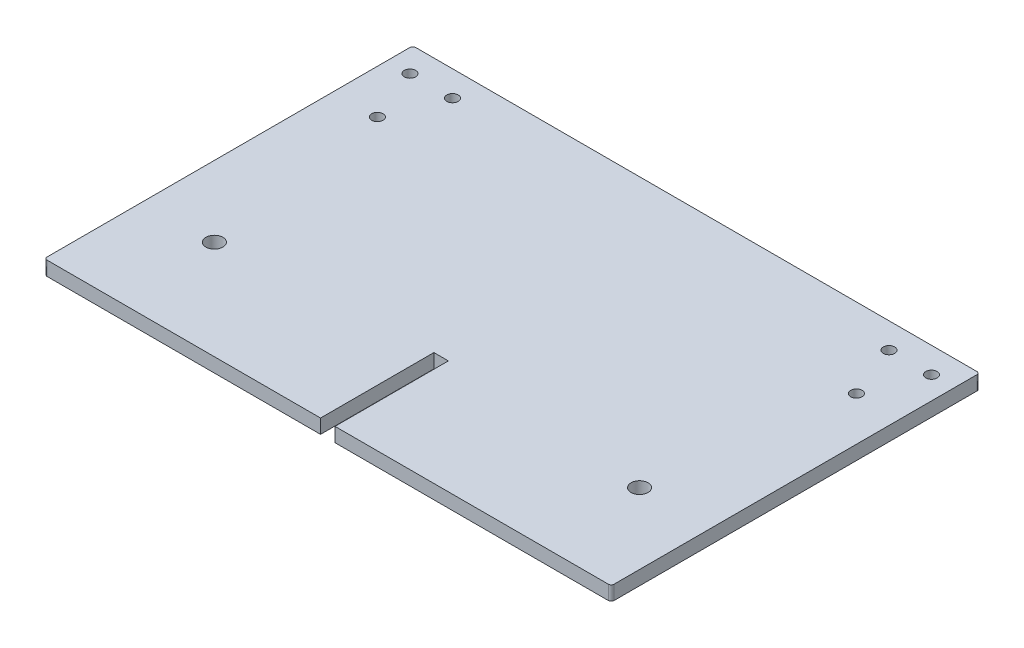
ISO-10303-21;
HEADER;
FILE_DESCRIPTION(('STEP AP214'),'2;1');
FILE_NAME('part.step','',(''),(''),'','','');
FILE_SCHEMA(('AUTOMOTIVE_DESIGN { 1 0 10303 214 1 1 1 1 }'));
ENDSEC;
DATA;
#1=APPLICATION_CONTEXT('core data for automotive mechanical design processes');
#2=APPLICATION_PROTOCOL_DEFINITION('international standard','automotive_design',2000,#1);
#3=PRODUCT_CONTEXT('',#1,'mechanical');
#4=PRODUCT('Part','Part','',(#3));
#5=PRODUCT_RELATED_PRODUCT_CATEGORY('part','',(#4));
#6=PRODUCT_DEFINITION_FORMATION('','',#4);
#7=PRODUCT_DEFINITION_CONTEXT('part definition',#1,'design');
#8=PRODUCT_DEFINITION('design','',#6,#7);
#9=PRODUCT_DEFINITION_SHAPE('','',#8);
#10=(LENGTH_UNIT() NAMED_UNIT(*) SI_UNIT(.MILLI.,.METRE.));
#11=(NAMED_UNIT(*) PLANE_ANGLE_UNIT() SI_UNIT($,.RADIAN.));
#12=(NAMED_UNIT(*) SI_UNIT($,.STERADIAN.) SOLID_ANGLE_UNIT());
#13=UNCERTAINTY_MEASURE_WITH_UNIT(LENGTH_MEASURE(1.E-05),#10,'distance_accuracy_value','');
#14=(GEOMETRIC_REPRESENTATION_CONTEXT(3) GLOBAL_UNCERTAINTY_ASSIGNED_CONTEXT((#13)) GLOBAL_UNIT_ASSIGNED_CONTEXT((#10,
#11,#12)) REPRESENTATION_CONTEXT('',''));
#15=CARTESIAN_POINT('',(0.,0.,0.));
#16=DIRECTION('',(0.,0.,1.));
#17=DIRECTION('',(1.,0.,0.));
#18=AXIS2_PLACEMENT_3D('',#15,#16,#17);
#19=CARTESIAN_POINT('',(0.,5.,0.));
#20=DIRECTION('',(0.,1.,0.));
#21=DIRECTION('',(0.,0.,1.));
#22=AXIS2_PLACEMENT_3D('',#19,#20,#21);
#23=PLANE('',#22);
#24=CARTESIAN_POINT('',(177.,5.,9.));
#25=DIRECTION('',(0.,1.,0.));
#26=DIRECTION('',(0.,0.,-1.));
#27=AXIS2_PLACEMENT_3D('',#24,#25,#26);
#28=CIRCLE('',#27,2.);
#29=CARTESIAN_POINT('',(177.,5.,7.));
#30=VERTEX_POINT('',#29);
#31=EDGE_CURVE('E275',#30,#30,#28,.T.);
#32=ORIENTED_EDGE('',*,*,#31,.F.);
#33=EDGE_LOOP('',(#32));
#34=FACE_BOUND('',#33,.T.);
#35=CARTESIAN_POINT('',(175.,5.,94.9999999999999));
#36=DIRECTION('',(0.,1.,0.));
#37=DIRECTION('',(0.,0.,-1.));
#38=AXIS2_PLACEMENT_3D('',#35,#36,#37);
#39=CIRCLE('',#38,3.00000000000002);
#40=CARTESIAN_POINT('',(175.,5.,91.9999999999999));
#41=VERTEX_POINT('',#40);
#42=EDGE_CURVE('E263',#41,#41,#39,.T.);
#43=ORIENTED_EDGE('',*,*,#42,.F.);
#44=EDGE_LOOP('',(#43));
#45=FACE_BOUND('',#44,.T.);
#46=CARTESIAN_POINT('',(15.5,5.,28.));
#47=DIRECTION('',(0.,1.,0.));
#48=DIRECTION('',(0.,0.,1.));
#49=AXIS2_PLACEMENT_3D('',#46,#47,#48);
#50=CIRCLE('',#49,2.00000000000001);
#51=CARTESIAN_POINT('',(15.5,5.,30.));
#52=VERTEX_POINT('',#51);
#53=EDGE_CURVE('E251',#52,#52,#50,.T.);
#54=ORIENTED_EDGE('',*,*,#53,.F.);
#55=EDGE_LOOP('',(#54));
#56=FACE_BOUND('',#55,.T.);
#57=CARTESIAN_POINT('',(8.,5.,9.));
#58=DIRECTION('',(0.,1.,0.));
#59=DIRECTION('',(0.,0.,1.));
#60=AXIS2_PLACEMENT_3D('',#57,#58,#59);
#61=CIRCLE('',#60,2.);
#62=CARTESIAN_POINT('',(8.,5.,11.));
#63=VERTEX_POINT('',#62);
#64=EDGE_CURVE('E164',#63,#63,#61,.T.);
#65=ORIENTED_EDGE('',*,*,#64,.F.);
#66=EDGE_LOOP('',(#65));
#67=FACE_BOUND('',#66,.T.);
#68=DIRECTION('',(-1.,0.,0.));
#69=VECTOR('',#68,1.);
#70=CARTESIAN_POINT('',(0.,5.,0.));
#71=LINE('',#70,#69);
#72=CARTESIAN_POINT('',(199.,5.,0.));
#73=VERTEX_POINT('',#72);
#74=CARTESIAN_POINT('',(1.,5.,0.));
#75=VERTEX_POINT('',#74);
#76=EDGE_CURVE('E158',#73,#75,#71,.T.);
#77=ORIENTED_EDGE('',*,*,#76,.T.);
#78=CARTESIAN_POINT('',(1.,5.,1.));
#79=DIRECTION('',(0.,1.,0.));
#80=DIRECTION('',(0.,0.,1.));
#81=AXIS2_PLACEMENT_3D('',#78,#79,#80);
#82=CIRCLE('',#81,1.);
#83=CARTESIAN_POINT('',(0.,5.,1.));
#84=VERTEX_POINT('',#83);
#85=EDGE_CURVE('E207',#75,#84,#82,.T.);
#86=ORIENTED_EDGE('',*,*,#85,.T.);
#87=DIRECTION('',(0.,0.,1.));
#88=VECTOR('',#87,1.);
#89=CARTESIAN_POINT('',(0.,5.,0.));
#90=LINE('',#89,#88);
#91=CARTESIAN_POINT('',(0.,5.,129.));
#92=VERTEX_POINT('',#91);
#93=EDGE_CURVE('E132',#84,#92,#90,.T.);
#94=ORIENTED_EDGE('',*,*,#93,.T.);
#95=CARTESIAN_POINT('',(1.00000000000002,5.,129.));
#96=DIRECTION('',(0.,1.,0.));
#97=DIRECTION('',(0.,0.,1.));
#98=AXIS2_PLACEMENT_3D('',#95,#96,#97);
#99=CIRCLE('',#98,1.);
#100=CARTESIAN_POINT('',(1.00000000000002,5.,130.));
#101=VERTEX_POINT('',#100);
#102=EDGE_CURVE('E128',#92,#101,#99,.T.);
#103=ORIENTED_EDGE('',*,*,#102,.T.);
#104=DIRECTION('',(1.,0.,0.));
#105=VECTOR('',#104,1.);
#106=CARTESIAN_POINT('',(0.,5.,130.));
#107=LINE('',#106,#105);
#108=CARTESIAN_POINT('',(97.45,5.,130.));
#109=VERTEX_POINT('',#108);
#110=EDGE_CURVE('E119',#101,#109,#107,.T.);
#111=ORIENTED_EDGE('',*,*,#110,.T.);
#112=DIRECTION('',(0.,0.,-1.));
#113=VECTOR('',#112,1.);
#114=CARTESIAN_POINT('',(97.45,5.,130.));
#115=LINE('',#114,#113);
#116=CARTESIAN_POINT('',(97.45,5.,90.));
#117=VERTEX_POINT('',#116);
#118=EDGE_CURVE('E124',#109,#117,#115,.T.);
#119=ORIENTED_EDGE('',*,*,#118,.T.);
#120=DIRECTION('',(1.,0.,0.));
#121=VECTOR('',#120,1.);
#122=CARTESIAN_POINT('',(102.55,5.,90.));
#123=LINE('',#122,#121);
#124=CARTESIAN_POINT('',(102.55,5.,90.));
#125=VERTEX_POINT('',#124);
#126=EDGE_CURVE('E147',#117,#125,#123,.T.);
#127=ORIENTED_EDGE('',*,*,#126,.T.);
#128=DIRECTION('',(0.,0.,1.));
#129=VECTOR('',#128,1.);
#130=CARTESIAN_POINT('',(102.55,5.,130.));
#131=LINE('',#130,#129);
#132=CARTESIAN_POINT('',(102.55,5.,130.));
#133=VERTEX_POINT('',#132);
#134=EDGE_CURVE('E149',#125,#133,#131,.T.);
#135=ORIENTED_EDGE('',*,*,#134,.T.);
#136=DIRECTION('',(1.,0.,0.));
#137=VECTOR('',#136,1.);
#138=CARTESIAN_POINT('',(102.55,5.,130.));
#139=LINE('',#138,#137);
#140=CARTESIAN_POINT('',(199.,5.,130.));
#141=VERTEX_POINT('',#140);
#142=EDGE_CURVE('E154',#133,#141,#139,.T.);
#143=ORIENTED_EDGE('',*,*,#142,.T.);
#144=CARTESIAN_POINT('',(199.,5.,129.));
#145=DIRECTION('',(0.,1.,0.));
#146=DIRECTION('',(0.,0.,1.));
#147=AXIS2_PLACEMENT_3D('',#144,#145,#146);
#148=CIRCLE('',#147,1.);
#149=CARTESIAN_POINT('',(200.,5.,129.));
#150=VERTEX_POINT('',#149);
#151=EDGE_CURVE('E53',#141,#150,#148,.T.);
#152=ORIENTED_EDGE('',*,*,#151,.T.);
#153=DIRECTION('',(0.,0.,-1.));
#154=VECTOR('',#153,1.);
#155=CARTESIAN_POINT('',(200.,5.,0.));
#156=LINE('',#155,#154);
#157=CARTESIAN_POINT('',(200.,5.,1.));
#158=VERTEX_POINT('',#157);
#159=EDGE_CURVE('E156',#150,#158,#156,.T.);
#160=ORIENTED_EDGE('',*,*,#159,.T.);
#161=CARTESIAN_POINT('',(199.,5.,1.));
#162=DIRECTION('',(0.,1.,0.));
#163=DIRECTION('',(0.,0.,1.));
#164=AXIS2_PLACEMENT_3D('',#161,#162,#163);
#165=CIRCLE('',#164,1.);
#166=EDGE_CURVE('E204',#158,#73,#165,.T.);
#167=ORIENTED_EDGE('',*,*,#166,.T.);
#168=EDGE_LOOP('',(#77,#86,#94,#103,#111,#119,#127,#135,#143,#152,#160,#167));
#169=FACE_BOUND('',#168,.T.);
#170=CARTESIAN_POINT('',(23.,5.,9.));
#171=DIRECTION('',(0.,1.,0.));
#172=DIRECTION('',(0.,0.,1.));
#173=AXIS2_PLACEMENT_3D('',#170,#171,#172);
#174=CIRCLE('',#173,2.);
#175=CARTESIAN_POINT('',(23.,5.,11.));
#176=VERTEX_POINT('',#175);
#177=EDGE_CURVE('E245',#176,#176,#174,.T.);
#178=ORIENTED_EDGE('',*,*,#177,.F.);
#179=EDGE_LOOP('',(#178));
#180=FACE_BOUND('',#179,.T.);
#181=CARTESIAN_POINT('',(25.,5.,95.));
#182=DIRECTION('',(0.,1.,0.));
#183=DIRECTION('',(0.,0.,1.));
#184=AXIS2_PLACEMENT_3D('',#181,#182,#183);
#185=CIRCLE('',#184,3.);
#186=CARTESIAN_POINT('',(25.,5.,98.));
#187=VERTEX_POINT('',#186);
#188=EDGE_CURVE('E257',#187,#187,#185,.T.);
#189=ORIENTED_EDGE('',*,*,#188,.F.);
#190=EDGE_LOOP('',(#189));
#191=FACE_BOUND('',#190,.T.);
#192=CARTESIAN_POINT('',(184.5,5.,28.));
#193=DIRECTION('',(0.,1.,0.));
#194=DIRECTION('',(0.,0.,-1.));
#195=AXIS2_PLACEMENT_3D('',#192,#193,#194);
#196=CIRCLE('',#195,2.00000000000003);
#197=CARTESIAN_POINT('',(184.5,5.,26.));
#198=VERTEX_POINT('',#197);
#199=EDGE_CURVE('E269',#198,#198,#196,.T.);
#200=ORIENTED_EDGE('',*,*,#199,.F.);
#201=EDGE_LOOP('',(#200));
#202=FACE_BOUND('',#201,.T.);
#203=CARTESIAN_POINT('',(192.,5.,9.));
#204=DIRECTION('',(0.,1.,0.));
#205=DIRECTION('',(0.,0.,-1.));
#206=AXIS2_PLACEMENT_3D('',#203,#204,#205);
#207=CIRCLE('',#206,2.);
#208=CARTESIAN_POINT('',(192.,5.,7.));
#209=VERTEX_POINT('',#208);
#210=EDGE_CURVE('E281',#209,#209,#207,.T.);
#211=ORIENTED_EDGE('',*,*,#210,.F.);
#212=EDGE_LOOP('',(#211));
#213=FACE_BOUND('',#212,.T.);
#214=ADVANCED_FACE('F32',(#34,#45,#56,#67,#169,#180,#191,#202,#213),#23,.T.);
#215=CARTESIAN_POINT('',(0.,0.,0.));
#216=DIRECTION('',(0.,1.,0.));
#217=DIRECTION('',(0.,0.,1.));
#218=AXIS2_PLACEMENT_3D('',#215,#216,#217);
#219=PLANE('',#218);
#220=CARTESIAN_POINT('',(177.,0.,9.));
#221=DIRECTION('',(0.,1.,0.));
#222=DIRECTION('',(0.,0.,-1.));
#223=AXIS2_PLACEMENT_3D('',#220,#221,#222);
#224=CIRCLE('',#223,2.);
#225=CARTESIAN_POINT('',(177.,0.,7.));
#226=VERTEX_POINT('',#225);
#227=EDGE_CURVE('E278',#226,#226,#224,.T.);
#228=ORIENTED_EDGE('',*,*,#227,.T.);
#229=EDGE_LOOP('',(#228));
#230=FACE_BOUND('',#229,.T.);
#231=CARTESIAN_POINT('',(175.,0.,94.9999999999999));
#232=DIRECTION('',(0.,1.,0.));
#233=DIRECTION('',(0.,0.,-1.));
#234=AXIS2_PLACEMENT_3D('',#231,#232,#233);
#235=CIRCLE('',#234,3.00000000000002);
#236=CARTESIAN_POINT('',(175.,0.,91.9999999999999));
#237=VERTEX_POINT('',#236);
#238=EDGE_CURVE('E266',#237,#237,#235,.T.);
#239=ORIENTED_EDGE('',*,*,#238,.T.);
#240=EDGE_LOOP('',(#239));
#241=FACE_BOUND('',#240,.T.);
#242=CARTESIAN_POINT('',(15.5,0.,28.));
#243=DIRECTION('',(0.,1.,0.));
#244=DIRECTION('',(0.,0.,1.));
#245=AXIS2_PLACEMENT_3D('',#242,#243,#244);
#246=CIRCLE('',#245,2.00000000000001);
#247=CARTESIAN_POINT('',(15.5,0.,30.));
#248=VERTEX_POINT('',#247);
#249=EDGE_CURVE('E254',#248,#248,#246,.T.);
#250=ORIENTED_EDGE('',*,*,#249,.T.);
#251=EDGE_LOOP('',(#250));
#252=FACE_BOUND('',#251,.T.);
#253=CARTESIAN_POINT('',(8.,0.,9.));
#254=DIRECTION('',(0.,1.,0.));
#255=DIRECTION('',(0.,0.,1.));
#256=AXIS2_PLACEMENT_3D('',#253,#254,#255);
#257=CIRCLE('',#256,2.);
#258=CARTESIAN_POINT('',(8.,0.,11.));
#259=VERTEX_POINT('',#258);
#260=EDGE_CURVE('E242',#259,#259,#257,.T.);
#261=ORIENTED_EDGE('',*,*,#260,.T.);
#262=EDGE_LOOP('',(#261));
#263=FACE_BOUND('',#262,.T.);
#264=DIRECTION('',(0.,0.,1.));
#265=VECTOR('',#264,1.);
#266=CARTESIAN_POINT('',(0.,0.,0.));
#267=LINE('',#266,#265);
#268=CARTESIAN_POINT('',(0.,0.,1.));
#269=VERTEX_POINT('',#268);
#270=CARTESIAN_POINT('',(0.,0.,129.));
#271=VERTEX_POINT('',#270);
#272=EDGE_CURVE('E161',#269,#271,#267,.T.);
#273=ORIENTED_EDGE('',*,*,#272,.F.);
#274=CARTESIAN_POINT('',(1.,0.,1.));
#275=DIRECTION('',(0.,1.,0.));
#276=DIRECTION('',(0.,0.,1.));
#277=AXIS2_PLACEMENT_3D('',#274,#275,#276);
#278=CIRCLE('',#277,1.);
#279=CARTESIAN_POINT('',(1.,0.,0.));
#280=VERTEX_POINT('',#279);
#281=EDGE_CURVE('E196',#269,#280,#278,.F.);
#282=ORIENTED_EDGE('',*,*,#281,.T.);
#283=DIRECTION('',(-1.,0.,0.));
#284=VECTOR('',#283,1.);
#285=CARTESIAN_POINT('',(0.,0.,0.));
#286=LINE('',#285,#284);
#287=CARTESIAN_POINT('',(199.,0.,0.));
#288=VERTEX_POINT('',#287);
#289=EDGE_CURVE('E177',#288,#280,#286,.T.);
#290=ORIENTED_EDGE('',*,*,#289,.F.);
#291=CARTESIAN_POINT('',(199.,0.,1.));
#292=DIRECTION('',(0.,1.,0.));
#293=DIRECTION('',(0.,0.,1.));
#294=AXIS2_PLACEMENT_3D('',#291,#292,#293);
#295=CIRCLE('',#294,1.);
#296=CARTESIAN_POINT('',(200.,0.,1.));
#297=VERTEX_POINT('',#296);
#298=EDGE_CURVE('E192',#288,#297,#295,.F.);
#299=ORIENTED_EDGE('',*,*,#298,.T.);
#300=DIRECTION('',(0.,0.,-1.));
#301=VECTOR('',#300,1.);
#302=CARTESIAN_POINT('',(200.,0.,0.));
#303=LINE('',#302,#301);
#304=CARTESIAN_POINT('',(200.,0.,129.));
#305=VERTEX_POINT('',#304);
#306=EDGE_CURVE('E175',#305,#297,#303,.T.);
#307=ORIENTED_EDGE('',*,*,#306,.F.);
#308=CARTESIAN_POINT('',(199.,0.,129.));
#309=DIRECTION('',(0.,1.,0.));
#310=DIRECTION('',(0.,0.,1.));
#311=AXIS2_PLACEMENT_3D('',#308,#309,#310);
#312=CIRCLE('',#311,1.);
#313=CARTESIAN_POINT('',(199.,0.,130.));
#314=VERTEX_POINT('',#313);
#315=EDGE_CURVE('E190',#305,#314,#312,.F.);
#316=ORIENTED_EDGE('',*,*,#315,.T.);
#317=DIRECTION('',(1.,0.,0.));
#318=VECTOR('',#317,1.);
#319=CARTESIAN_POINT('',(102.55,0.,130.));
#320=LINE('',#319,#318);
#321=CARTESIAN_POINT('',(102.55,0.,130.));
#322=VERTEX_POINT('',#321);
#323=EDGE_CURVE('E172',#322,#314,#320,.T.);
#324=ORIENTED_EDGE('',*,*,#323,.F.);
#325=DIRECTION('',(0.,0.,1.));
#326=VECTOR('',#325,1.);
#327=CARTESIAN_POINT('',(102.55,0.,130.));
#328=LINE('',#327,#326);
#329=CARTESIAN_POINT('',(102.55,0.,90.));
#330=VERTEX_POINT('',#329);
#331=EDGE_CURVE('E170',#330,#322,#328,.T.);
#332=ORIENTED_EDGE('',*,*,#331,.F.);
#333=DIRECTION('',(1.,0.,0.));
#334=VECTOR('',#333,1.);
#335=CARTESIAN_POINT('',(102.55,0.,90.));
#336=LINE('',#335,#334);
#337=CARTESIAN_POINT('',(97.45,0.,90.));
#338=VERTEX_POINT('',#337);
#339=EDGE_CURVE('E168',#338,#330,#336,.T.);
#340=ORIENTED_EDGE('',*,*,#339,.F.);
#341=DIRECTION('',(0.,0.,-1.));
#342=VECTOR('',#341,1.);
#343=CARTESIAN_POINT('',(97.45,0.,130.));
#344=LINE('',#343,#342);
#345=CARTESIAN_POINT('',(97.45,0.,130.));
#346=VERTEX_POINT('',#345);
#347=EDGE_CURVE('E166',#346,#338,#344,.T.);
#348=ORIENTED_EDGE('',*,*,#347,.F.);
#349=DIRECTION('',(1.,0.,0.));
#350=VECTOR('',#349,1.);
#351=CARTESIAN_POINT('',(0.,0.,130.));
#352=LINE('',#351,#350);
#353=CARTESIAN_POINT('',(1.00000000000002,0.,130.));
#354=VERTEX_POINT('',#353);
#355=EDGE_CURVE('E138',#354,#346,#352,.T.);
#356=ORIENTED_EDGE('',*,*,#355,.F.);
#357=CARTESIAN_POINT('',(1.00000000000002,0.,129.));
#358=DIRECTION('',(0.,1.,0.));
#359=DIRECTION('',(0.,0.,1.));
#360=AXIS2_PLACEMENT_3D('',#357,#358,#359);
#361=CIRCLE('',#360,1.);
#362=EDGE_CURVE('E194',#354,#271,#361,.F.);
#363=ORIENTED_EDGE('',*,*,#362,.T.);
#364=EDGE_LOOP('',(#273,#282,#290,#299,#307,#316,#324,#332,#340,#348,#356,#363));
#365=FACE_BOUND('',#364,.T.);
#366=CARTESIAN_POINT('',(23.,0.,9.));
#367=DIRECTION('',(0.,1.,0.));
#368=DIRECTION('',(0.,0.,1.));
#369=AXIS2_PLACEMENT_3D('',#366,#367,#368);
#370=CIRCLE('',#369,2.);
#371=CARTESIAN_POINT('',(23.,0.,11.));
#372=VERTEX_POINT('',#371);
#373=EDGE_CURVE('E248',#372,#372,#370,.T.);
#374=ORIENTED_EDGE('',*,*,#373,.T.);
#375=EDGE_LOOP('',(#374));
#376=FACE_BOUND('',#375,.T.);
#377=CARTESIAN_POINT('',(25.,0.,95.));
#378=DIRECTION('',(0.,1.,0.));
#379=DIRECTION('',(0.,0.,1.));
#380=AXIS2_PLACEMENT_3D('',#377,#378,#379);
#381=CIRCLE('',#380,3.);
#382=CARTESIAN_POINT('',(25.,0.,98.));
#383=VERTEX_POINT('',#382);
#384=EDGE_CURVE('E260',#383,#383,#381,.T.);
#385=ORIENTED_EDGE('',*,*,#384,.T.);
#386=EDGE_LOOP('',(#385));
#387=FACE_BOUND('',#386,.T.);
#388=CARTESIAN_POINT('',(184.5,0.,28.));
#389=DIRECTION('',(0.,1.,0.));
#390=DIRECTION('',(0.,0.,-1.));
#391=AXIS2_PLACEMENT_3D('',#388,#389,#390);
#392=CIRCLE('',#391,2.00000000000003);
#393=CARTESIAN_POINT('',(184.5,0.,26.));
#394=VERTEX_POINT('',#393);
#395=EDGE_CURVE('E272',#394,#394,#392,.T.);
#396=ORIENTED_EDGE('',*,*,#395,.T.);
#397=EDGE_LOOP('',(#396));
#398=FACE_BOUND('',#397,.T.);
#399=CARTESIAN_POINT('',(192.,0.,9.));
#400=DIRECTION('',(0.,1.,0.));
#401=DIRECTION('',(0.,0.,-1.));
#402=AXIS2_PLACEMENT_3D('',#399,#400,#401);
#403=CIRCLE('',#402,2.);
#404=CARTESIAN_POINT('',(192.,0.,7.));
#405=VERTEX_POINT('',#404);
#406=EDGE_CURVE('E284',#405,#405,#403,.T.);
#407=ORIENTED_EDGE('',*,*,#406,.T.);
#408=EDGE_LOOP('',(#407));
#409=FACE_BOUND('',#408,.T.);
#410=ADVANCED_FACE('F219',(#230,#241,#252,#263,#365,#376,#387,#398,#409),#219,.F.);
#411=CARTESIAN_POINT('',(0.,5.,0.));
#412=DIRECTION('',(1.,0.,0.));
#413=DIRECTION('',(0.,0.,-1.));
#414=AXIS2_PLACEMENT_3D('',#411,#412,#413);
#415=PLANE('',#414);
#416=ORIENTED_EDGE('',*,*,#93,.F.);
#417=DIRECTION('',(0.,-1.,0.));
#418=VECTOR('',#417,1.);
#419=CARTESIAN_POINT('',(0.,5.,1.));
#420=LINE('',#419,#418);
#421=EDGE_CURVE('E187',#84,#269,#420,.T.);
#422=ORIENTED_EDGE('',*,*,#421,.T.);
#423=ORIENTED_EDGE('',*,*,#272,.T.);
#424=DIRECTION('',(0.,-1.,0.));
#425=VECTOR('',#424,1.);
#426=CARTESIAN_POINT('',(0.,5.,129.));
#427=LINE('',#426,#425);
#428=EDGE_CURVE('E141',#271,#92,#427,.F.);
#429=ORIENTED_EDGE('',*,*,#428,.T.);
#430=EDGE_LOOP('',(#416,#422,#423,#429));
#431=FACE_BOUND('',#430,.T.);
#432=ADVANCED_FACE('F237',(#431),#415,.F.);
#433=CARTESIAN_POINT('',(0.,5.,130.));
#434=DIRECTION('',(0.,0.,-1.));
#435=DIRECTION('',(-1.,0.,0.));
#436=AXIS2_PLACEMENT_3D('',#433,#434,#435);
#437=PLANE('',#436);
#438=ORIENTED_EDGE('',*,*,#110,.F.);
#439=DIRECTION('',(0.,-1.,0.));
#440=VECTOR('',#439,1.);
#441=CARTESIAN_POINT('',(1.00000000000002,5.,130.));
#442=LINE('',#441,#440);
#443=EDGE_CURVE('E209',#101,#354,#442,.T.);
#444=ORIENTED_EDGE('',*,*,#443,.T.);
#445=ORIENTED_EDGE('',*,*,#355,.T.);
#446=DIRECTION('',(0.,-1.,0.));
#447=VECTOR('',#446,1.);
#448=CARTESIAN_POINT('',(97.45,5.,130.));
#449=LINE('',#448,#447);
#450=EDGE_CURVE('E135',#109,#346,#449,.T.);
#451=ORIENTED_EDGE('',*,*,#450,.F.);
#452=EDGE_LOOP('',(#438,#444,#445,#451));
#453=FACE_BOUND('',#452,.T.);
#454=ADVANCED_FACE('F136',(#453),#437,.F.);
#455=CARTESIAN_POINT('',(97.45,5.,130.));
#456=DIRECTION('',(-1.,0.,0.));
#457=DIRECTION('',(0.,0.,1.));
#458=AXIS2_PLACEMENT_3D('',#455,#456,#457);
#459=PLANE('',#458);
#460=ORIENTED_EDGE('',*,*,#347,.T.);
#461=DIRECTION('',(0.,-1.,0.));
#462=VECTOR('',#461,1.);
#463=CARTESIAN_POINT('',(97.45,5.,90.));
#464=LINE('',#463,#462);
#465=EDGE_CURVE('E142',#117,#338,#464,.T.);
#466=ORIENTED_EDGE('',*,*,#465,.F.);
#467=ORIENTED_EDGE('',*,*,#118,.F.);
#468=ORIENTED_EDGE('',*,*,#450,.T.);
#469=EDGE_LOOP('',(#460,#466,#467,#468));
#470=FACE_BOUND('',#469,.T.);
#471=ADVANCED_FACE('F144',(#470),#459,.F.);
#472=CARTESIAN_POINT('',(102.55,5.,90.));
#473=DIRECTION('',(0.,0.,-1.));
#474=DIRECTION('',(-1.,0.,0.));
#475=AXIS2_PLACEMENT_3D('',#472,#473,#474);
#476=PLANE('',#475);
#477=ORIENTED_EDGE('',*,*,#339,.T.);
#478=DIRECTION('',(0.,-1.,0.));
#479=VECTOR('',#478,1.);
#480=CARTESIAN_POINT('',(102.55,5.,90.));
#481=LINE('',#480,#479);
#482=EDGE_CURVE('E182',#125,#330,#481,.T.);
#483=ORIENTED_EDGE('',*,*,#482,.F.);
#484=ORIENTED_EDGE('',*,*,#126,.F.);
#485=ORIENTED_EDGE('',*,*,#465,.T.);
#486=EDGE_LOOP('',(#477,#483,#484,#485));
#487=FACE_BOUND('',#486,.T.);
#488=ADVANCED_FACE('F318',(#487),#476,.F.);
#489=CARTESIAN_POINT('',(102.55,5.,130.));
#490=DIRECTION('',(1.,0.,0.));
#491=DIRECTION('',(0.,0.,-1.));
#492=AXIS2_PLACEMENT_3D('',#489,#490,#491);
#493=PLANE('',#492);
#494=ORIENTED_EDGE('',*,*,#331,.T.);
#495=DIRECTION('',(0.,-1.,0.));
#496=VECTOR('',#495,1.);
#497=CARTESIAN_POINT('',(102.55,5.,130.));
#498=LINE('',#497,#496);
#499=EDGE_CURVE('E160',#133,#322,#498,.T.);
#500=ORIENTED_EDGE('',*,*,#499,.F.);
#501=ORIENTED_EDGE('',*,*,#134,.F.);
#502=ORIENTED_EDGE('',*,*,#482,.T.);
#503=EDGE_LOOP('',(#494,#500,#501,#502));
#504=FACE_BOUND('',#503,.T.);
#505=ADVANCED_FACE('F314',(#504),#493,.F.);
#506=CARTESIAN_POINT('',(102.55,5.,130.));
#507=DIRECTION('',(0.,0.,-1.));
#508=DIRECTION('',(-1.,0.,0.));
#509=AXIS2_PLACEMENT_3D('',#506,#507,#508);
#510=PLANE('',#509);
#511=ORIENTED_EDGE('',*,*,#323,.T.);
#512=DIRECTION('',(0.,-1.,0.));
#513=VECTOR('',#512,1.);
#514=CARTESIAN_POINT('',(199.,5.,130.));
#515=LINE('',#514,#513);
#516=EDGE_CURVE('E11',#314,#141,#515,.F.);
#517=ORIENTED_EDGE('',*,*,#516,.T.);
#518=ORIENTED_EDGE('',*,*,#142,.F.);
#519=ORIENTED_EDGE('',*,*,#499,.T.);
#520=EDGE_LOOP('',(#511,#517,#518,#519));
#521=FACE_BOUND('',#520,.T.);
#522=ADVANCED_FACE('F311',(#521),#510,.F.);
#523=CARTESIAN_POINT('',(200.,5.,0.));
#524=DIRECTION('',(-1.,0.,0.));
#525=DIRECTION('',(0.,0.,1.));
#526=AXIS2_PLACEMENT_3D('',#523,#524,#525);
#527=PLANE('',#526);
#528=ORIENTED_EDGE('',*,*,#306,.T.);
#529=DIRECTION('',(0.,-1.,0.));
#530=VECTOR('',#529,1.);
#531=CARTESIAN_POINT('',(200.,5.,1.));
#532=LINE('',#531,#530);
#533=EDGE_CURVE('E40',#297,#158,#532,.F.);
#534=ORIENTED_EDGE('',*,*,#533,.T.);
#535=ORIENTED_EDGE('',*,*,#159,.F.);
#536=DIRECTION('',(0.,-1.,0.));
#537=VECTOR('',#536,1.);
#538=CARTESIAN_POINT('',(200.,5.,129.));
#539=LINE('',#538,#537);
#540=EDGE_CURVE('E211',#150,#305,#539,.T.);
#541=ORIENTED_EDGE('',*,*,#540,.T.);
#542=EDGE_LOOP('',(#528,#534,#535,#541));
#543=FACE_BOUND('',#542,.T.);
#544=ADVANCED_FACE('F215',(#543),#527,.F.);
#545=CARTESIAN_POINT('',(0.,5.,0.));
#546=DIRECTION('',(0.,0.,1.));
#547=DIRECTION('',(1.,0.,0.));
#548=AXIS2_PLACEMENT_3D('',#545,#546,#547);
#549=PLANE('',#548);
#550=ORIENTED_EDGE('',*,*,#289,.T.);
#551=DIRECTION('',(0.,-1.,0.));
#552=VECTOR('',#551,1.);
#553=CARTESIAN_POINT('',(1.,5.,0.));
#554=LINE('',#553,#552);
#555=EDGE_CURVE('E201',#280,#75,#554,.F.);
#556=ORIENTED_EDGE('',*,*,#555,.T.);
#557=ORIENTED_EDGE('',*,*,#76,.F.);
#558=DIRECTION('',(0.,-1.,0.));
#559=VECTOR('',#558,1.);
#560=CARTESIAN_POINT('',(199.,5.,0.));
#561=LINE('',#560,#559);
#562=EDGE_CURVE('E198',#73,#288,#561,.T.);
#563=ORIENTED_EDGE('',*,*,#562,.T.);
#564=EDGE_LOOP('',(#550,#556,#557,#563));
#565=FACE_BOUND('',#564,.T.);
#566=ADVANCED_FACE('F229',(#565),#549,.F.);
#567=CARTESIAN_POINT('',(8.,5.,9.));
#568=DIRECTION('',(0.,-1.,0.));
#569=DIRECTION('',(0.,0.,-1.));
#570=AXIS2_PLACEMENT_3D('',#567,#568,#569);
#571=CYLINDRICAL_SURFACE('',#570,2.);
#572=ORIENTED_EDGE('',*,*,#64,.T.);
#573=EDGE_LOOP('',(#572));
#574=FACE_BOUND('',#573,.T.);
#575=ORIENTED_EDGE('',*,*,#260,.F.);
#576=EDGE_LOOP('',(#575));
#577=FACE_BOUND('',#576,.T.);
#578=ADVANCED_FACE('F304',(#574,#577),#571,.F.);
#579=CARTESIAN_POINT('',(23.,5.,9.));
#580=DIRECTION('',(0.,-1.,0.));
#581=DIRECTION('',(0.,0.,-1.));
#582=AXIS2_PLACEMENT_3D('',#579,#580,#581);
#583=CYLINDRICAL_SURFACE('',#582,2.);
#584=ORIENTED_EDGE('',*,*,#177,.T.);
#585=EDGE_LOOP('',(#584));
#586=FACE_BOUND('',#585,.T.);
#587=ORIENTED_EDGE('',*,*,#373,.F.);
#588=EDGE_LOOP('',(#587));
#589=FACE_BOUND('',#588,.T.);
#590=ADVANCED_FACE('F463',(#586,#589),#583,.F.);
#591=CARTESIAN_POINT('',(15.5,5.,28.));
#592=DIRECTION('',(0.,-1.,0.));
#593=DIRECTION('',(0.,0.,-1.));
#594=AXIS2_PLACEMENT_3D('',#591,#592,#593);
#595=CYLINDRICAL_SURFACE('',#594,2.00000000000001);
#596=ORIENTED_EDGE('',*,*,#53,.T.);
#597=EDGE_LOOP('',(#596));
#598=FACE_BOUND('',#597,.T.);
#599=ORIENTED_EDGE('',*,*,#249,.F.);
#600=EDGE_LOOP('',(#599));
#601=FACE_BOUND('',#600,.T.);
#602=ADVANCED_FACE('F453',(#598,#601),#595,.F.);
#603=CARTESIAN_POINT('',(25.,5.,95.));
#604=DIRECTION('',(0.,-1.,0.));
#605=DIRECTION('',(0.,0.,-1.));
#606=AXIS2_PLACEMENT_3D('',#603,#604,#605);
#607=CYLINDRICAL_SURFACE('',#606,3.);
#608=ORIENTED_EDGE('',*,*,#188,.T.);
#609=EDGE_LOOP('',(#608));
#610=FACE_BOUND('',#609,.T.);
#611=ORIENTED_EDGE('',*,*,#384,.F.);
#612=EDGE_LOOP('',(#611));
#613=FACE_BOUND('',#612,.T.);
#614=ADVANCED_FACE('F443',(#610,#613),#607,.F.);
#615=CARTESIAN_POINT('',(175.,5.,94.9999999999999));
#616=DIRECTION('',(0.,-1.,0.));
#617=DIRECTION('',(0.,0.,-1.));
#618=AXIS2_PLACEMENT_3D('',#615,#616,#617);
#619=CYLINDRICAL_SURFACE('',#618,3.00000000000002);
#620=ORIENTED_EDGE('',*,*,#42,.T.);
#621=EDGE_LOOP('',(#620));
#622=FACE_BOUND('',#621,.T.);
#623=ORIENTED_EDGE('',*,*,#238,.F.);
#624=EDGE_LOOP('',(#623));
#625=FACE_BOUND('',#624,.T.);
#626=ADVANCED_FACE('F433',(#622,#625),#619,.F.);
#627=CARTESIAN_POINT('',(184.5,5.,28.));
#628=DIRECTION('',(0.,-1.,0.));
#629=DIRECTION('',(0.,0.,-1.));
#630=AXIS2_PLACEMENT_3D('',#627,#628,#629);
#631=CYLINDRICAL_SURFACE('',#630,2.00000000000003);
#632=ORIENTED_EDGE('',*,*,#199,.T.);
#633=EDGE_LOOP('',(#632));
#634=FACE_BOUND('',#633,.T.);
#635=ORIENTED_EDGE('',*,*,#395,.F.);
#636=EDGE_LOOP('',(#635));
#637=FACE_BOUND('',#636,.T.);
#638=ADVANCED_FACE('F423',(#634,#637),#631,.F.);
#639=CARTESIAN_POINT('',(177.,5.,9.));
#640=DIRECTION('',(0.,-1.,0.));
#641=DIRECTION('',(0.,0.,-1.));
#642=AXIS2_PLACEMENT_3D('',#639,#640,#641);
#643=CYLINDRICAL_SURFACE('',#642,2.);
#644=ORIENTED_EDGE('',*,*,#31,.T.);
#645=EDGE_LOOP('',(#644));
#646=FACE_BOUND('',#645,.T.);
#647=ORIENTED_EDGE('',*,*,#227,.F.);
#648=EDGE_LOOP('',(#647));
#649=FACE_BOUND('',#648,.T.);
#650=ADVANCED_FACE('F414',(#646,#649),#643,.F.);
#651=CARTESIAN_POINT('',(192.,5.,9.));
#652=DIRECTION('',(0.,-1.,0.));
#653=DIRECTION('',(0.,0.,-1.));
#654=AXIS2_PLACEMENT_3D('',#651,#652,#653);
#655=CYLINDRICAL_SURFACE('',#654,2.);
#656=ORIENTED_EDGE('',*,*,#210,.T.);
#657=EDGE_LOOP('',(#656));
#658=FACE_BOUND('',#657,.T.);
#659=ORIENTED_EDGE('',*,*,#406,.F.);
#660=EDGE_LOOP('',(#659));
#661=FACE_BOUND('',#660,.T.);
#662=ADVANCED_FACE('F290',(#658,#661),#655,.F.);
#663=CARTESIAN_POINT('',(1.,5.,1.));
#664=DIRECTION('',(0.,-1.,0.));
#665=DIRECTION('',(0.,0.,-1.));
#666=AXIS2_PLACEMENT_3D('',#663,#664,#665);
#667=CYLINDRICAL_SURFACE('',#666,1.);
#668=ORIENTED_EDGE('',*,*,#85,.F.);
#669=ORIENTED_EDGE('',*,*,#555,.F.);
#670=ORIENTED_EDGE('',*,*,#281,.F.);
#671=ORIENTED_EDGE('',*,*,#421,.F.);
#672=EDGE_LOOP('',(#668,#669,#670,#671));
#673=FACE_BOUND('',#672,.T.);
#674=ADVANCED_FACE('F235',(#673),#667,.T.);
#675=CARTESIAN_POINT('',(1.00000000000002,5.,129.));
#676=DIRECTION('',(0.,-1.,0.));
#677=DIRECTION('',(0.,0.,-1.));
#678=AXIS2_PLACEMENT_3D('',#675,#676,#677);
#679=CYLINDRICAL_SURFACE('',#678,1.);
#680=ORIENTED_EDGE('',*,*,#102,.F.);
#681=ORIENTED_EDGE('',*,*,#428,.F.);
#682=ORIENTED_EDGE('',*,*,#362,.F.);
#683=ORIENTED_EDGE('',*,*,#443,.F.);
#684=EDGE_LOOP('',(#680,#681,#682,#683));
#685=FACE_BOUND('',#684,.T.);
#686=ADVANCED_FACE('F240',(#685),#679,.T.);
#687=CARTESIAN_POINT('',(199.,5.,1.));
#688=DIRECTION('',(0.,-1.,0.));
#689=DIRECTION('',(0.,0.,-1.));
#690=AXIS2_PLACEMENT_3D('',#687,#688,#689);
#691=CYLINDRICAL_SURFACE('',#690,1.);
#692=ORIENTED_EDGE('',*,*,#166,.F.);
#693=ORIENTED_EDGE('',*,*,#533,.F.);
#694=ORIENTED_EDGE('',*,*,#298,.F.);
#695=ORIENTED_EDGE('',*,*,#562,.F.);
#696=EDGE_LOOP('',(#692,#693,#694,#695));
#697=FACE_BOUND('',#696,.T.);
#698=ADVANCED_FACE('F226',(#697),#691,.T.);
#699=CARTESIAN_POINT('',(199.,5.,129.));
#700=DIRECTION('',(0.,-1.,0.));
#701=DIRECTION('',(0.,0.,-1.));
#702=AXIS2_PLACEMENT_3D('',#699,#700,#701);
#703=CYLINDRICAL_SURFACE('',#702,1.);
#704=ORIENTED_EDGE('',*,*,#151,.F.);
#705=ORIENTED_EDGE('',*,*,#516,.F.);
#706=ORIENTED_EDGE('',*,*,#315,.F.);
#707=ORIENTED_EDGE('',*,*,#540,.F.);
#708=EDGE_LOOP('',(#704,#705,#706,#707));
#709=FACE_BOUND('',#708,.T.);
#710=ADVANCED_FACE('F34',(#709),#703,.T.);
#711=CLOSED_SHELL('',(#214,#410,#432,#454,#471,#488,#505,#522,#544,#566,#578,#590,#602,#614,
#626,#638,#650,#662,#674,#686,#698,#710));
#712=MANIFOLD_SOLID_BREP('B2',#711);
#713=ADVANCED_BREP_SHAPE_REPRESENTATION('',(#18,#712),#14);
#714=SHAPE_DEFINITION_REPRESENTATION(#9,#713);
ENDSEC;
END-ISO-10303-21;
